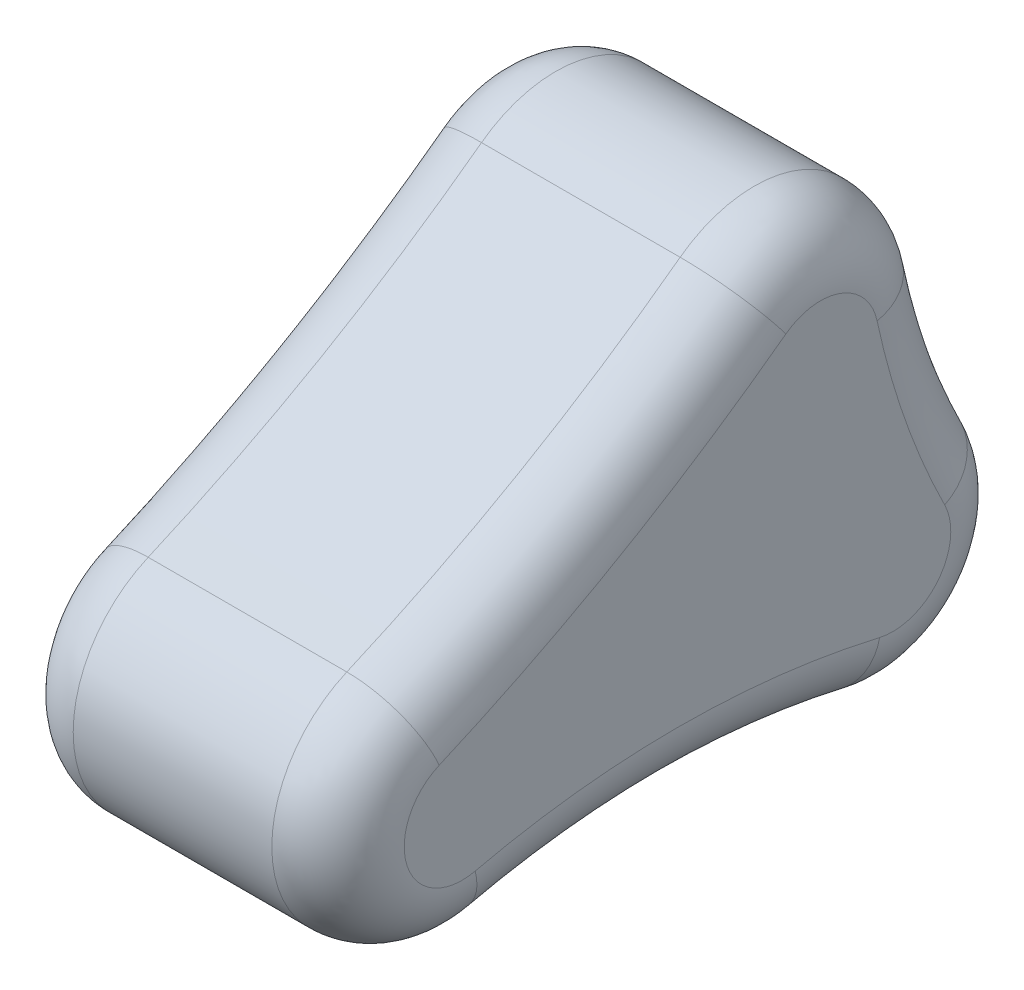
ISO-10303-21;
HEADER;
FILE_DESCRIPTION(('STEP AP214'),'2;1');
FILE_NAME('part.step','',(''),(''),'','','');
FILE_SCHEMA(('AUTOMOTIVE_DESIGN { 1 0 10303 214 1 1 1 1 }'));
ENDSEC;
DATA;
#1=APPLICATION_CONTEXT('core data for automotive mechanical design processes');
#2=APPLICATION_PROTOCOL_DEFINITION('international standard','automotive_design',2000,#1);
#3=PRODUCT_CONTEXT('',#1,'mechanical');
#4=PRODUCT('Part','Part','',(#3));
#5=PRODUCT_RELATED_PRODUCT_CATEGORY('part','',(#4));
#6=PRODUCT_DEFINITION_FORMATION('','',#4);
#7=PRODUCT_DEFINITION_CONTEXT('part definition',#1,'design');
#8=PRODUCT_DEFINITION('design','',#6,#7);
#9=PRODUCT_DEFINITION_SHAPE('','',#8);
#10=(LENGTH_UNIT() NAMED_UNIT(*) SI_UNIT(.MILLI.,.METRE.));
#11=(NAMED_UNIT(*) PLANE_ANGLE_UNIT() SI_UNIT($,.RADIAN.));
#12=(NAMED_UNIT(*) SI_UNIT($,.STERADIAN.) SOLID_ANGLE_UNIT());
#13=UNCERTAINTY_MEASURE_WITH_UNIT(LENGTH_MEASURE(1.E-05),#10,'distance_accuracy_value','');
#14=(GEOMETRIC_REPRESENTATION_CONTEXT(3) GLOBAL_UNCERTAINTY_ASSIGNED_CONTEXT((#13)) GLOBAL_UNIT_ASSIGNED_CONTEXT((#10,
#11,#12)) REPRESENTATION_CONTEXT('',''));
#15=CARTESIAN_POINT('',(0.,0.,0.));
#16=DIRECTION('',(0.,0.,1.));
#17=DIRECTION('',(1.,0.,0.));
#18=AXIS2_PLACEMENT_3D('',#15,#16,#17);
#19=CARTESIAN_POINT('',(63.5,-1103.40350261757,-286.75330139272));
#20=DIRECTION('',(1.,0.,0.));
#21=DIRECTION('',(0.,0.,-1.));
#22=AXIS2_PLACEMENT_3D('',#19,#20,#21);
#23=CYLINDRICAL_SURFACE('',#22,228.6);
#24=DIRECTION('',(1.,0.,0.));
#25=VECTOR('',#24,1.);
#26=CARTESIAN_POINT('',(63.5,-1205.49908248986,-82.2185792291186));
#27=LINE('',#26,#25);
#28=CARTESIAN_POINT('',(83.82,-1205.49908248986,-82.2185792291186));
#29=VERTEX_POINT('',#28);
#30=CARTESIAN_POINT('',(144.78,-1205.49908248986,-82.2185792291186));
#31=VERTEX_POINT('',#30);
#32=EDGE_CURVE('E146',#29,#31,#27,.T.);
#33=ORIENTED_EDGE('',*,*,#32,.F.);
#34=CARTESIAN_POINT('',(83.82,-1103.40350261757,-286.75330139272));
#35=DIRECTION('',(-1.,0.,0.));
#36=DIRECTION('',(0.,0.,1.));
#37=AXIS2_PLACEMENT_3D('',#34,#35,#36);
#38=CIRCLE('',#37,228.6);
#39=CARTESIAN_POINT('',(83.82,-1151.07051106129,-63.1782215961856));
#40=VERTEX_POINT('',#39);
#41=EDGE_CURVE('E195',#29,#40,#38,.T.);
#42=ORIENTED_EDGE('',*,*,#41,.T.);
#43=DIRECTION('',(1.,0.,0.));
#44=VECTOR('',#43,1.);
#45=CARTESIAN_POINT('',(63.5,-1151.07051106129,-63.1782215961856));
#46=LINE('',#45,#44);
#47=CARTESIAN_POINT('',(144.78,-1151.07051106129,-63.1782215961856));
#48=VERTEX_POINT('',#47);
#49=EDGE_CURVE('E152',#40,#48,#46,.T.);
#50=ORIENTED_EDGE('',*,*,#49,.T.);
#51=CARTESIAN_POINT('',(144.78,-1103.40350261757,-286.75330139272));
#52=DIRECTION('',(-1.,0.,0.));
#53=DIRECTION('',(0.,0.,1.));
#54=AXIS2_PLACEMENT_3D('',#51,#52,#53);
#55=CIRCLE('',#54,228.6);
#56=EDGE_CURVE('E190',#48,#31,#55,.F.);
#57=ORIENTED_EDGE('',*,*,#56,.T.);
#58=EDGE_LOOP('',(#33,#42,#50,#57));
#59=FACE_BOUND('',#58,.T.);
#60=ADVANCED_FACE('F35',(#59),#23,.F.);
#61=CARTESIAN_POINT('',(63.5,-1222.51501246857,-48.1294588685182));
#62=DIRECTION('',(1.,0.,0.));
#63=DIRECTION('',(0.,0.,-1.));
#64=AXIS2_PLACEMENT_3D('',#61,#62,#63);
#65=CYLINDRICAL_SURFACE('',#64,38.1000000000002);
#66=ORIENTED_EDGE('',*,*,#32,.T.);
#67=CARTESIAN_POINT('',(144.78,-1222.51501246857,-48.1294588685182));
#68=DIRECTION('',(-1.,0.,0.));
#69=DIRECTION('',(0.,0.,1.));
#70=AXIS2_PLACEMENT_3D('',#67,#68,#69);
#71=CIRCLE('',#70,38.1000000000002);
#72=CARTESIAN_POINT('',(144.78,-1259.62669209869,-39.5077864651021));
#73=VERTEX_POINT('',#72);
#74=EDGE_CURVE('E252',#31,#73,#71,.T.);
#75=ORIENTED_EDGE('',*,*,#74,.T.);
#76=DIRECTION('',(1.,0.,0.));
#77=VECTOR('',#76,1.);
#78=CARTESIAN_POINT('',(63.5,-1259.62669209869,-39.5077864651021));
#79=LINE('',#78,#77);
#80=CARTESIAN_POINT('',(83.82,-1259.62669209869,-39.5077864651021));
#81=VERTEX_POINT('',#80);
#82=EDGE_CURVE('E247',#81,#73,#79,.T.);
#83=ORIENTED_EDGE('',*,*,#82,.F.);
#84=CARTESIAN_POINT('',(83.82,-1222.51501246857,-48.1294588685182));
#85=DIRECTION('',(-1.,0.,0.));
#86=DIRECTION('',(0.,0.,1.));
#87=AXIS2_PLACEMENT_3D('',#84,#85,#86);
#88=CIRCLE('',#87,38.1000000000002);
#89=EDGE_CURVE('E251',#81,#29,#88,.F.);
#90=ORIENTED_EDGE('',*,*,#89,.T.);
#91=EDGE_LOOP('',(#66,#75,#83,#90));
#92=FACE_BOUND('',#91,.T.);
#93=ADVANCED_FACE('F250',(#92),#65,.T.);
#94=CARTESIAN_POINT('',(63.5,-1507.03788963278,17.9700295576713));
#95=DIRECTION('',(1.,0.,0.));
#96=DIRECTION('',(0.,0.,-1.));
#97=AXIS2_PLACEMENT_3D('',#94,#95,#96);
#98=CYLINDRICAL_SURFACE('',#97,254.);
#99=DIRECTION('',(1.,0.,0.));
#100=VECTOR('',#99,1.);
#101=CARTESIAN_POINT('',(63.5,-1259.62669209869,75.4478455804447));
#102=LINE('',#101,#100);
#103=CARTESIAN_POINT('',(83.82,-1259.62669209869,75.4478455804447));
#104=VERTEX_POINT('',#103);
#105=CARTESIAN_POINT('',(144.78,-1259.62669209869,75.4478455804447));
#106=VERTEX_POINT('',#105);
#107=EDGE_CURVE('E223',#104,#106,#102,.T.);
#108=ORIENTED_EDGE('',*,*,#107,.F.);
#109=CARTESIAN_POINT('',(83.82,-1507.03788963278,17.9700295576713));
#110=DIRECTION('',(-1.,0.,0.));
#111=DIRECTION('',(0.,0.,1.));
#112=AXIS2_PLACEMENT_3D('',#109,#110,#111);
#113=CIRCLE('',#112,254.);
#114=EDGE_CURVE('E203',#104,#81,#113,.T.);
#115=ORIENTED_EDGE('',*,*,#114,.T.);
#116=ORIENTED_EDGE('',*,*,#82,.T.);
#117=CARTESIAN_POINT('',(144.78,-1507.03788963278,17.9700295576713));
#118=DIRECTION('',(-1.,0.,0.));
#119=DIRECTION('',(0.,0.,1.));
#120=AXIS2_PLACEMENT_3D('',#117,#118,#119);
#121=CIRCLE('',#120,254.);
#122=EDGE_CURVE('E197',#73,#106,#121,.F.);
#123=ORIENTED_EDGE('',*,*,#122,.T.);
#124=EDGE_LOOP('',(#108,#115,#116,#123));
#125=FACE_BOUND('',#124,.T.);
#126=ADVANCED_FACE('F246',(#125),#98,.F.);
#127=CARTESIAN_POINT('',(63.5,-1222.51501246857,84.0695179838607));
#128=DIRECTION('',(1.,0.,0.));
#129=DIRECTION('',(0.,0.,-1.));
#130=AXIS2_PLACEMENT_3D('',#127,#128,#129);
#131=CYLINDRICAL_SURFACE('',#130,38.1000000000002);
#132=ORIENTED_EDGE('',*,*,#107,.T.);
#133=CARTESIAN_POINT('',(144.78,-1222.51501246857,84.0695179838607));
#134=DIRECTION('',(-1.,0.,0.));
#135=DIRECTION('',(0.,0.,1.));
#136=AXIS2_PLACEMENT_3D('',#133,#134,#135);
#137=CIRCLE('',#136,38.1000000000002);
#138=CARTESIAN_POINT('',(144.78,-1187.52815104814,99.15359992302));
#139=VERTEX_POINT('',#138);
#140=EDGE_CURVE('E222',#106,#139,#137,.T.);
#141=ORIENTED_EDGE('',*,*,#140,.T.);
#142=DIRECTION('',(1.,0.,0.));
#143=VECTOR('',#142,1.);
#144=CARTESIAN_POINT('',(63.5,-1187.52815104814,99.15359992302));
#145=LINE('',#144,#143);
#146=CARTESIAN_POINT('',(83.82,-1187.52815104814,99.15359992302));
#147=VERTEX_POINT('',#146);
#148=EDGE_CURVE('E210',#147,#139,#145,.T.);
#149=ORIENTED_EDGE('',*,*,#148,.F.);
#150=CARTESIAN_POINT('',(83.82,-1222.51501246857,84.0695179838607));
#151=DIRECTION('',(-1.,0.,0.));
#152=DIRECTION('',(0.,0.,1.));
#153=AXIS2_PLACEMENT_3D('',#150,#151,#152);
#154=CIRCLE('',#153,38.1000000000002);
#155=EDGE_CURVE('E219',#147,#104,#154,.F.);
#156=ORIENTED_EDGE('',*,*,#155,.T.);
#157=EDGE_LOOP('',(#132,#141,#149,#156));
#158=FACE_BOUND('',#157,.T.);
#159=ADVANCED_FACE('F218',(#158),#131,.T.);
#160=CARTESIAN_POINT('',(63.5,-721.036665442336,300.274692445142));
#161=DIRECTION('',(1.,0.,0.));
#162=DIRECTION('',(0.,0.,-1.));
#163=AXIS2_PLACEMENT_3D('',#160,#161,#162);
#164=CYLINDRICAL_SURFACE('',#163,508.);
#165=ORIENTED_EDGE('',*,*,#148,.T.);
#166=CARTESIAN_POINT('',(144.78,-721.036665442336,300.274692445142));
#167=DIRECTION('',(-1.,0.,0.));
#168=DIRECTION('',(0.,0.,1.));
#169=AXIS2_PLACEMENT_3D('',#166,#167,#168);
#170=CIRCLE('',#169,508.);
#171=CARTESIAN_POINT('',(144.78,-1128.45838360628,-3.15823847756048));
#172=VERTEX_POINT('',#171);
#173=EDGE_CURVE('E11',#139,#172,#170,.F.);
#174=ORIENTED_EDGE('',*,*,#173,.T.);
#175=DIRECTION('',(1.,0.,0.));
#176=VECTOR('',#175,1.);
#177=CARTESIAN_POINT('',(63.5,-1128.45838360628,-3.15823847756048));
#178=LINE('',#177,#176);
#179=CARTESIAN_POINT('',(83.82,-1128.45838360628,-3.15823847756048));
#180=VERTEX_POINT('',#179);
#181=EDGE_CURVE('E212',#180,#172,#178,.T.);
#182=ORIENTED_EDGE('',*,*,#181,.F.);
#183=CARTESIAN_POINT('',(83.82,-721.036665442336,300.274692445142));
#184=DIRECTION('',(-1.,0.,0.));
#185=DIRECTION('',(0.,0.,1.));
#186=AXIS2_PLACEMENT_3D('',#183,#184,#185);
#187=CIRCLE('',#186,508.);
#188=EDGE_CURVE('E44',#180,#147,#187,.T.);
#189=ORIENTED_EDGE('',*,*,#188,.T.);
#190=EDGE_LOOP('',(#165,#174,#182,#189));
#191=FACE_BOUND('',#190,.T.);
#192=ADVANCED_FACE('F209',(#191),#164,.F.);
#193=CARTESIAN_POINT('',(63.5,-1159.01501246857,-25.9157082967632));
#194=DIRECTION('',(1.,0.,0.));
#195=DIRECTION('',(0.,0.,-1.));
#196=AXIS2_PLACEMENT_3D('',#193,#194,#195);
#197=CYLINDRICAL_SURFACE('',#196,38.1);
#198=ORIENTED_EDGE('',*,*,#181,.T.);
#199=CARTESIAN_POINT('',(144.78,-1159.01501246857,-25.9157082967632));
#200=DIRECTION('',(-1.,0.,0.));
#201=DIRECTION('',(0.,0.,1.));
#202=AXIS2_PLACEMENT_3D('',#199,#200,#201);
#203=CIRCLE('',#202,38.1);
#204=EDGE_CURVE('E149',#172,#48,#203,.T.);
#205=ORIENTED_EDGE('',*,*,#204,.T.);
#206=ORIENTED_EDGE('',*,*,#49,.F.);
#207=CARTESIAN_POINT('',(83.82,-1159.01501246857,-25.9157082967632));
#208=DIRECTION('',(-1.,0.,0.));
#209=DIRECTION('',(0.,0.,1.));
#210=AXIS2_PLACEMENT_3D('',#207,#208,#209);
#211=CIRCLE('',#210,38.1);
#212=EDGE_CURVE('E267',#40,#180,#211,.F.);
#213=ORIENTED_EDGE('',*,*,#212,.T.);
#214=EDGE_LOOP('',(#198,#205,#206,#213));
#215=FACE_BOUND('',#214,.T.);
#216=ADVANCED_FACE('F271',(#215),#197,.T.);
#217=CARTESIAN_POINT('',(63.5,-1131.20925754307,-156.334504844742));
#218=DIRECTION('',(-1.,0.,0.));
#219=DIRECTION('',(0.,0.,1.));
#220=AXIS2_PLACEMENT_3D('',#217,#218,#219);
#221=PLANE('',#220);
#222=CARTESIAN_POINT('',(63.5,-1159.01501246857,-25.9157082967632));
#223=DIRECTION('',(-1.,0.,0.));
#224=DIRECTION('',(0.,0.,1.));
#225=AXIS2_PLACEMENT_3D('',#222,#223,#224);
#226=CIRCLE('',#225,17.78);
#227=CARTESIAN_POINT('',(63.5,-1144.75525233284,-15.2955557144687));
#228=VERTEX_POINT('',#227);
#229=CARTESIAN_POINT('',(63.5,-1155.30757847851,-43.304881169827));
#230=VERTEX_POINT('',#229);
#231=EDGE_CURVE('E234',#228,#230,#226,.T.);
#232=ORIENTED_EDGE('',*,*,#231,.T.);
#233=CARTESIAN_POINT('',(63.5,-1103.40350261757,-286.75330139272));
#234=DIRECTION('',(-1.,0.,0.));
#235=DIRECTION('',(0.,0.,1.));
#236=AXIS2_PLACEMENT_3D('',#233,#234,#235);
#237=CIRCLE('',#236,248.92);
#238=CARTESIAN_POINT('',(63.5,-1214.57424514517,-64.0377150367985));
#239=VERTEX_POINT('',#238);
#240=EDGE_CURVE('E52',#230,#239,#237,.F.);
#241=ORIENTED_EDGE('',*,*,#240,.T.);
#242=CARTESIAN_POINT('',(63.5,-1222.51501246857,-48.1294588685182));
#243=DIRECTION('',(-1.,0.,0.));
#244=DIRECTION('',(0.,0.,1.));
#245=AXIS2_PLACEMENT_3D('',#242,#243,#244);
#246=CIRCLE('',#245,17.7800000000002);
#247=CARTESIAN_POINT('',(63.5,-1239.83379629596,-44.106011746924));
#248=VERTEX_POINT('',#247);
#249=EDGE_CURVE('E56',#239,#248,#246,.T.);
#250=ORIENTED_EDGE('',*,*,#249,.T.);
#251=CARTESIAN_POINT('',(63.5,-1507.03788963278,17.9700295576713));
#252=DIRECTION('',(-1.,0.,0.));
#253=DIRECTION('',(0.,0.,1.));
#254=AXIS2_PLACEMENT_3D('',#251,#252,#253);
#255=CIRCLE('',#254,274.32);
#256=CARTESIAN_POINT('',(63.5,-1239.83379629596,80.0460708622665));
#257=VERTEX_POINT('',#256);
#258=EDGE_CURVE('E239',#248,#257,#255,.F.);
#259=ORIENTED_EDGE('',*,*,#258,.T.);
#260=CARTESIAN_POINT('',(63.5,-1222.51501246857,84.0695179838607));
#261=DIRECTION('',(-1.,0.,0.));
#262=DIRECTION('',(0.,0.,1.));
#263=AXIS2_PLACEMENT_3D('',#260,#261,#262);
#264=CIRCLE('',#263,17.7800000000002);
#265=CARTESIAN_POINT('',(63.5,-1206.18781047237,91.1087562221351));
#266=VERTEX_POINT('',#265);
#267=EDGE_CURVE('E232',#257,#266,#264,.T.);
#268=ORIENTED_EDGE('',*,*,#267,.T.);
#269=CARTESIAN_POINT('',(63.5,-721.036665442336,300.274692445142));
#270=DIRECTION('',(-1.,0.,0.));
#271=DIRECTION('',(0.,0.,1.));
#272=AXIS2_PLACEMENT_3D('',#269,#270,#271);
#273=CIRCLE('',#272,528.32);
#274=EDGE_CURVE('E230',#266,#228,#273,.F.);
#275=ORIENTED_EDGE('',*,*,#274,.T.);
#276=EDGE_LOOP('',(#232,#241,#250,#259,#268,#275));
#277=FACE_BOUND('',#276,.T.);
#278=ADVANCED_FACE('F240',(#277),#221,.T.);
#279=CARTESIAN_POINT('',(165.1,-1131.20925754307,-156.334504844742));
#280=DIRECTION('',(-1.,0.,0.));
#281=DIRECTION('',(0.,0.,1.));
#282=AXIS2_PLACEMENT_3D('',#279,#280,#281);
#283=PLANE('',#282);
#284=CARTESIAN_POINT('',(165.1,-1507.03788963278,17.9700295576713));
#285=DIRECTION('',(-1.,0.,0.));
#286=DIRECTION('',(0.,0.,1.));
#287=AXIS2_PLACEMENT_3D('',#284,#285,#286);
#288=CIRCLE('',#287,274.32);
#289=CARTESIAN_POINT('',(165.1,-1239.83379629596,80.0460708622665));
#290=VERTEX_POINT('',#289);
#291=CARTESIAN_POINT('',(165.1,-1239.83379629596,-44.106011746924));
#292=VERTEX_POINT('',#291);
#293=EDGE_CURVE('E261',#290,#292,#288,.T.);
#294=ORIENTED_EDGE('',*,*,#293,.T.);
#295=CARTESIAN_POINT('',(165.1,-1222.51501246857,-48.1294588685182));
#296=DIRECTION('',(-1.,0.,0.));
#297=DIRECTION('',(0.,0.,1.));
#298=AXIS2_PLACEMENT_3D('',#295,#296,#297);
#299=CIRCLE('',#298,17.7800000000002);
#300=CARTESIAN_POINT('',(165.1,-1214.57424514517,-64.0377150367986));
#301=VERTEX_POINT('',#300);
#302=EDGE_CURVE('E263',#292,#301,#299,.F.);
#303=ORIENTED_EDGE('',*,*,#302,.T.);
#304=CARTESIAN_POINT('',(165.1,-1103.40350261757,-286.75330139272));
#305=DIRECTION('',(-1.,0.,0.));
#306=DIRECTION('',(0.,0.,1.));
#307=AXIS2_PLACEMENT_3D('',#304,#305,#306);
#308=CIRCLE('',#307,248.92);
#309=CARTESIAN_POINT('',(165.1,-1155.30757847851,-43.304881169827));
#310=VERTEX_POINT('',#309);
#311=EDGE_CURVE('E130',#301,#310,#308,.T.);
#312=ORIENTED_EDGE('',*,*,#311,.T.);
#313=CARTESIAN_POINT('',(165.1,-1159.01501246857,-25.9157082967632));
#314=DIRECTION('',(-1.,0.,0.));
#315=DIRECTION('',(0.,0.,1.));
#316=AXIS2_PLACEMENT_3D('',#313,#314,#315);
#317=CIRCLE('',#316,17.78);
#318=CARTESIAN_POINT('',(165.1,-1144.75525233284,-15.2955557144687));
#319=VERTEX_POINT('',#318);
#320=EDGE_CURVE('E123',#310,#319,#317,.F.);
#321=ORIENTED_EDGE('',*,*,#320,.T.);
#322=CARTESIAN_POINT('',(165.1,-721.036665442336,300.274692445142));
#323=DIRECTION('',(-1.,0.,0.));
#324=DIRECTION('',(0.,0.,1.));
#325=AXIS2_PLACEMENT_3D('',#322,#323,#324);
#326=CIRCLE('',#325,528.32);
#327=CARTESIAN_POINT('',(165.1,-1206.18781047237,91.1087562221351));
#328=VERTEX_POINT('',#327);
#329=EDGE_CURVE('E126',#319,#328,#326,.T.);
#330=ORIENTED_EDGE('',*,*,#329,.T.);
#331=CARTESIAN_POINT('',(165.1,-1222.51501246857,84.0695179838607));
#332=DIRECTION('',(-1.,0.,0.));
#333=DIRECTION('',(0.,0.,1.));
#334=AXIS2_PLACEMENT_3D('',#331,#332,#333);
#335=CIRCLE('',#334,17.7800000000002);
#336=EDGE_CURVE('E135',#328,#290,#335,.F.);
#337=ORIENTED_EDGE('',*,*,#336,.T.);
#338=EDGE_LOOP('',(#294,#303,#312,#321,#330,#337));
#339=FACE_BOUND('',#338,.T.);
#340=ADVANCED_FACE('F125',(#339),#283,.F.);
#341=CARTESIAN_POINT('',(144.78,-721.036665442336,300.274692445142));
#342=DIRECTION('',(-1.,0.,0.));
#343=DIRECTION('',(0.,0.,1.));
#344=AXIS2_PLACEMENT_3D('',#341,#342,#343);
#345=TOROIDAL_SURFACE('',#344,528.32,20.32);
#346=CARTESIAN_POINT('',(144.78,-1144.75525233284,-15.2955557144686));
#347=DIRECTION('',(0.,0.597308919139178,-0.802011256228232));
#348=DIRECTION('',(0.,0.802011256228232,0.597308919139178));
#349=AXIS2_PLACEMENT_3D('',#346,#347,#348);
#350=CIRCLE('',#349,20.32);
#351=EDGE_CURVE('E141',#172,#319,#350,.T.);
#352=ORIENTED_EDGE('',*,*,#351,.F.);
#353=ORIENTED_EDGE('',*,*,#173,.F.);
#354=CARTESIAN_POINT('',(144.78,-1206.18781047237,91.1087562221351));
#355=DIRECTION('',(0.,-0.395907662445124,0.918290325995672));
#356=DIRECTION('',(0.,-0.918290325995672,-0.395907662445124));
#357=AXIS2_PLACEMENT_3D('',#354,#355,#356);
#358=CIRCLE('',#357,20.32);
#359=EDGE_CURVE('E144',#328,#139,#358,.T.);
#360=ORIENTED_EDGE('',*,*,#359,.F.);
#361=ORIENTED_EDGE('',*,*,#329,.F.);
#362=EDGE_LOOP('',(#352,#353,#360,#361));
#363=FACE_BOUND('',#362,.T.);
#364=ADVANCED_FACE('F139',(#363),#345,.T.);
#365=CARTESIAN_POINT('',(144.78,-1222.51501246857,84.0695179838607));
#366=DIRECTION('',(-1.,0.,0.));
#367=DIRECTION('',(0.,0.,1.));
#368=AXIS2_PLACEMENT_3D('',#365,#366,#367);
#369=DEGENERATE_TOROIDAL_SURFACE('',#368,17.7800000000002,20.32,.T.);
#370=ORIENTED_EDGE('',*,*,#359,.T.);
#371=ORIENTED_EDGE('',*,*,#140,.F.);
#372=CARTESIAN_POINT('',(144.78,-1239.83379629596,80.0460708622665));
#373=DIRECTION('',(0.,0.226290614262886,-0.974059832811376));
#374=DIRECTION('',(0.,0.974059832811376,0.226290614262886));
#375=AXIS2_PLACEMENT_3D('',#372,#373,#374);
#376=CIRCLE('',#375,20.32);
#377=EDGE_CURVE('E150',#290,#106,#376,.T.);
#378=ORIENTED_EDGE('',*,*,#377,.F.);
#379=ORIENTED_EDGE('',*,*,#336,.F.);
#380=EDGE_LOOP('',(#370,#371,#378,#379));
#381=FACE_BOUND('',#380,.T.);
#382=ADVANCED_FACE('F307',(#381),#369,.T.);
#383=CARTESIAN_POINT('',(144.78,-1159.01501246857,-25.9157082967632));
#384=DIRECTION('',(-1.,0.,0.));
#385=DIRECTION('',(0.,0.,1.));
#386=AXIS2_PLACEMENT_3D('',#383,#384,#385);
#387=DEGENERATE_TOROIDAL_SURFACE('',#386,17.78,20.32,.T.);
#388=ORIENTED_EDGE('',*,*,#351,.T.);
#389=ORIENTED_EDGE('',*,*,#320,.F.);
#390=CARTESIAN_POINT('',(144.78,-1155.30757847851,-43.304881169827));
#391=DIRECTION('',(0.,-0.978018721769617,-0.208517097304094));
#392=DIRECTION('',(0.,0.208517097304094,-0.978018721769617));
#393=AXIS2_PLACEMENT_3D('',#390,#391,#392);
#394=CIRCLE('',#393,20.32);
#395=EDGE_CURVE('E155',#48,#310,#394,.T.);
#396=ORIENTED_EDGE('',*,*,#395,.F.);
#397=ORIENTED_EDGE('',*,*,#204,.F.);
#398=EDGE_LOOP('',(#388,#389,#396,#397));
#399=FACE_BOUND('',#398,.T.);
#400=ADVANCED_FACE('F148',(#399),#387,.T.);
#401=CARTESIAN_POINT('',(144.78,-1507.03788963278,17.9700295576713));
#402=DIRECTION('',(-1.,0.,0.));
#403=DIRECTION('',(0.,0.,1.));
#404=AXIS2_PLACEMENT_3D('',#401,#402,#403);
#405=TOROIDAL_SURFACE('',#404,274.32,20.32);
#406=ORIENTED_EDGE('',*,*,#377,.T.);
#407=ORIENTED_EDGE('',*,*,#122,.F.);
#408=CARTESIAN_POINT('',(144.78,-1239.83379629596,-44.106011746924));
#409=DIRECTION('',(0.,-0.22629061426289,-0.974059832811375));
#410=DIRECTION('',(0.,0.974059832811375,-0.22629061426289));
#411=AXIS2_PLACEMENT_3D('',#408,#409,#410);
#412=CIRCLE('',#411,20.32);
#413=EDGE_CURVE('E179',#292,#73,#412,.T.);
#414=ORIENTED_EDGE('',*,*,#413,.F.);
#415=ORIENTED_EDGE('',*,*,#293,.F.);
#416=EDGE_LOOP('',(#406,#407,#414,#415));
#417=FACE_BOUND('',#416,.T.);
#418=ADVANCED_FACE('F301',(#417),#405,.T.);
#419=CARTESIAN_POINT('',(144.78,-1103.40350261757,-286.75330139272));
#420=DIRECTION('',(-1.,0.,0.));
#421=DIRECTION('',(0.,0.,1.));
#422=AXIS2_PLACEMENT_3D('',#419,#420,#421);
#423=TOROIDAL_SURFACE('',#422,248.92,20.32);
#424=ORIENTED_EDGE('',*,*,#395,.T.);
#425=ORIENTED_EDGE('',*,*,#311,.F.);
#426=CARTESIAN_POINT('',(144.78,-1214.57424514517,-64.0377150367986));
#427=DIRECTION('',(0.,-0.894727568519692,-0.446612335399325));
#428=DIRECTION('',(0.,0.446612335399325,-0.894727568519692));
#429=AXIS2_PLACEMENT_3D('',#426,#427,#428);
#430=CIRCLE('',#429,20.32);
#431=EDGE_CURVE('E175',#31,#301,#430,.T.);
#432=ORIENTED_EDGE('',*,*,#431,.F.);
#433=ORIENTED_EDGE('',*,*,#56,.F.);
#434=EDGE_LOOP('',(#424,#425,#432,#433));
#435=FACE_BOUND('',#434,.T.);
#436=ADVANCED_FACE('F189',(#435),#423,.T.);
#437=CARTESIAN_POINT('',(144.78,-1222.51501246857,-48.1294588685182));
#438=DIRECTION('',(-1.,0.,0.));
#439=DIRECTION('',(0.,0.,1.));
#440=AXIS2_PLACEMENT_3D('',#437,#438,#439);
#441=DEGENERATE_TOROIDAL_SURFACE('',#440,17.7800000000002,20.32,.T.);
#442=ORIENTED_EDGE('',*,*,#413,.T.);
#443=ORIENTED_EDGE('',*,*,#74,.F.);
#444=ORIENTED_EDGE('',*,*,#431,.T.);
#445=ORIENTED_EDGE('',*,*,#302,.F.);
#446=EDGE_LOOP('',(#442,#443,#444,#445));
#447=FACE_BOUND('',#446,.T.);
#448=ADVANCED_FACE('F296',(#447),#441,.T.);
#449=CARTESIAN_POINT('',(83.82,-1507.03788963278,17.9700295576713));
#450=DIRECTION('',(-1.,0.,0.));
#451=DIRECTION('',(0.,0.,1.));
#452=AXIS2_PLACEMENT_3D('',#449,#450,#451);
#453=TOROIDAL_SURFACE('',#452,274.32,20.32);
#454=CARTESIAN_POINT('',(83.82,-1239.83379629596,80.0460708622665));
#455=DIRECTION('',(0.,-0.226290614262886,0.974059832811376));
#456=DIRECTION('',(0.,-0.974059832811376,-0.226290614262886));
#457=AXIS2_PLACEMENT_3D('',#454,#455,#456);
#458=CIRCLE('',#457,20.32);
#459=EDGE_CURVE('E168',#257,#104,#458,.T.);
#460=ORIENTED_EDGE('',*,*,#459,.F.);
#461=ORIENTED_EDGE('',*,*,#258,.F.);
#462=CARTESIAN_POINT('',(83.82,-1239.83379629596,-44.1060117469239));
#463=DIRECTION('',(0.,-0.226290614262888,-0.974059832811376));
#464=DIRECTION('',(0.,0.974059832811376,-0.226290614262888));
#465=AXIS2_PLACEMENT_3D('',#462,#463,#464);
#466=CIRCLE('',#465,20.32);
#467=EDGE_CURVE('E39',#81,#248,#466,.T.);
#468=ORIENTED_EDGE('',*,*,#467,.F.);
#469=ORIENTED_EDGE('',*,*,#114,.F.);
#470=EDGE_LOOP('',(#460,#461,#468,#469));
#471=FACE_BOUND('',#470,.T.);
#472=ADVANCED_FACE('F37',(#471),#453,.T.);
#473=CARTESIAN_POINT('',(83.82,-1222.51501246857,-48.1294588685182));
#474=DIRECTION('',(-1.,0.,0.));
#475=DIRECTION('',(0.,0.,1.));
#476=AXIS2_PLACEMENT_3D('',#473,#474,#475);
#477=DEGENERATE_TOROIDAL_SURFACE('',#476,17.7800000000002,20.32,.T.);
#478=ORIENTED_EDGE('',*,*,#467,.T.);
#479=ORIENTED_EDGE('',*,*,#249,.F.);
#480=CARTESIAN_POINT('',(83.82,-1214.57424514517,-64.0377150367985));
#481=DIRECTION('',(0.,0.894727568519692,0.446612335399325));
#482=DIRECTION('',(0.,-0.446612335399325,0.894727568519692));
#483=AXIS2_PLACEMENT_3D('',#480,#481,#482);
#484=CIRCLE('',#483,20.32);
#485=EDGE_CURVE('E166',#29,#239,#484,.T.);
#486=ORIENTED_EDGE('',*,*,#485,.F.);
#487=ORIENTED_EDGE('',*,*,#89,.F.);
#488=EDGE_LOOP('',(#478,#479,#486,#487));
#489=FACE_BOUND('',#488,.T.);
#490=ADVANCED_FACE('F389',(#489),#477,.T.);
#491=CARTESIAN_POINT('',(83.82,-1222.51501246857,84.0695179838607));
#492=DIRECTION('',(-1.,0.,0.));
#493=DIRECTION('',(0.,0.,1.));
#494=AXIS2_PLACEMENT_3D('',#491,#492,#493);
#495=DEGENERATE_TOROIDAL_SURFACE('',#494,17.7800000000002,20.32,.T.);
#496=ORIENTED_EDGE('',*,*,#459,.T.);
#497=ORIENTED_EDGE('',*,*,#155,.F.);
#498=CARTESIAN_POINT('',(83.82,-1206.18781047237,91.1087562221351));
#499=DIRECTION('',(0.,0.395907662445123,-0.918290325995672));
#500=DIRECTION('',(0.,0.918290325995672,0.395907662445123));
#501=AXIS2_PLACEMENT_3D('',#498,#499,#500);
#502=CIRCLE('',#501,20.32);
#503=EDGE_CURVE('E163',#266,#147,#502,.T.);
#504=ORIENTED_EDGE('',*,*,#503,.F.);
#505=ORIENTED_EDGE('',*,*,#267,.F.);
#506=EDGE_LOOP('',(#496,#497,#504,#505));
#507=FACE_BOUND('',#506,.T.);
#508=ADVANCED_FACE('F226',(#507),#495,.T.);
#509=CARTESIAN_POINT('',(83.82,-1103.40350261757,-286.75330139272));
#510=DIRECTION('',(-1.,0.,0.));
#511=DIRECTION('',(0.,0.,1.));
#512=AXIS2_PLACEMENT_3D('',#509,#510,#511);
#513=TOROIDAL_SURFACE('',#512,248.92,20.32);
#514=ORIENTED_EDGE('',*,*,#485,.T.);
#515=ORIENTED_EDGE('',*,*,#240,.F.);
#516=CARTESIAN_POINT('',(83.82,-1155.30757847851,-43.304881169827));
#517=DIRECTION('',(0.,0.978018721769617,0.208517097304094));
#518=DIRECTION('',(0.,-0.208517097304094,0.978018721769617));
#519=AXIS2_PLACEMENT_3D('',#516,#517,#518);
#520=CIRCLE('',#519,20.32);
#521=EDGE_CURVE('E161',#40,#230,#520,.T.);
#522=ORIENTED_EDGE('',*,*,#521,.F.);
#523=ORIENTED_EDGE('',*,*,#41,.F.);
#524=EDGE_LOOP('',(#514,#515,#522,#523));
#525=FACE_BOUND('',#524,.T.);
#526=ADVANCED_FACE('F276',(#525),#513,.T.);
#527=CARTESIAN_POINT('',(83.82,-721.036665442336,300.274692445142));
#528=DIRECTION('',(-1.,0.,0.));
#529=DIRECTION('',(0.,0.,1.));
#530=AXIS2_PLACEMENT_3D('',#527,#528,#529);
#531=TOROIDAL_SURFACE('',#530,528.32,20.32);
#532=ORIENTED_EDGE('',*,*,#503,.T.);
#533=ORIENTED_EDGE('',*,*,#188,.F.);
#534=CARTESIAN_POINT('',(83.82,-1144.75525233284,-15.2955557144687));
#535=DIRECTION('',(0.,0.597308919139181,-0.80201125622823));
#536=DIRECTION('',(0.,0.80201125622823,0.597308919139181));
#537=AXIS2_PLACEMENT_3D('',#534,#535,#536);
#538=CIRCLE('',#537,20.32);
#539=EDGE_CURVE('E159',#228,#180,#538,.T.);
#540=ORIENTED_EDGE('',*,*,#539,.F.);
#541=ORIENTED_EDGE('',*,*,#274,.F.);
#542=EDGE_LOOP('',(#532,#533,#540,#541));
#543=FACE_BOUND('',#542,.T.);
#544=ADVANCED_FACE('F229',(#543),#531,.T.);
#545=CARTESIAN_POINT('',(83.82,-1159.01501246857,-25.9157082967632));
#546=DIRECTION('',(-1.,0.,0.));
#547=DIRECTION('',(0.,0.,1.));
#548=AXIS2_PLACEMENT_3D('',#545,#546,#547);
#549=DEGENERATE_TOROIDAL_SURFACE('',#548,17.78,20.32,.T.);
#550=ORIENTED_EDGE('',*,*,#521,.T.);
#551=ORIENTED_EDGE('',*,*,#231,.F.);
#552=ORIENTED_EDGE('',*,*,#539,.T.);
#553=ORIENTED_EDGE('',*,*,#212,.F.);
#554=EDGE_LOOP('',(#550,#551,#552,#553));
#555=FACE_BOUND('',#554,.T.);
#556=ADVANCED_FACE('F279',(#555),#549,.T.);
#557=CLOSED_SHELL('',(#60,#93,#126,#159,#192,#216,#278,#340,#364,#382,#400,#418,#436,#448,#472,
#490,#508,#526,#544,#556));
#558=MANIFOLD_SOLID_BREP('B2',#557);
#559=ADVANCED_BREP_SHAPE_REPRESENTATION('',(#18,#558),#14);
#560=SHAPE_DEFINITION_REPRESENTATION(#9,#559);
ENDSEC;
END-ISO-10303-21;
